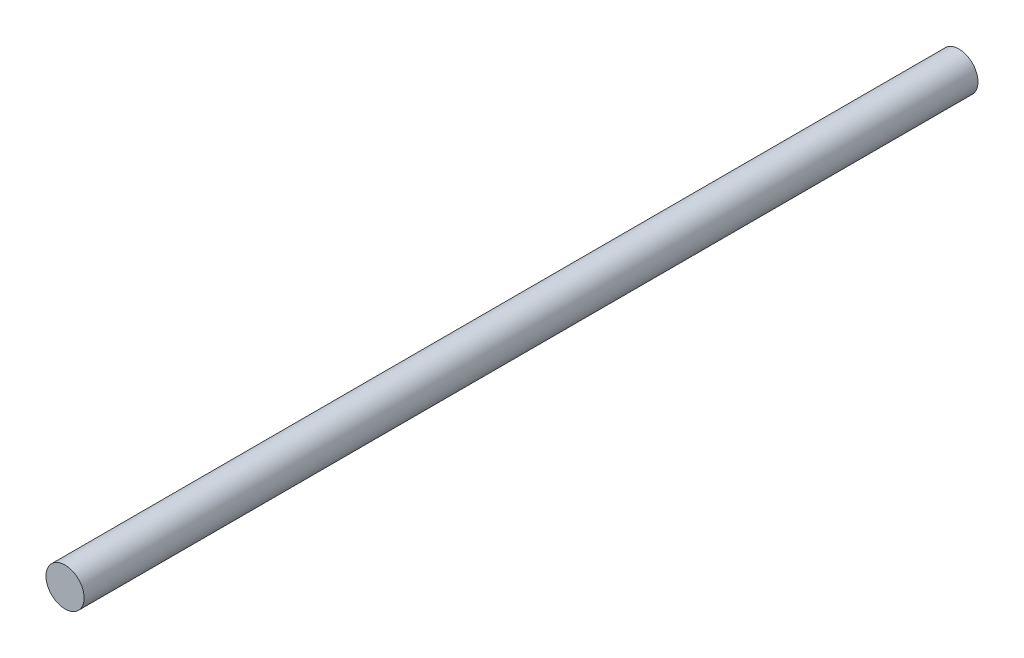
from build123d import *

# Parameters (mm, degrees)
SKETCH_1_R      = 1.6
EXTRUDE_1_DEPTH = 75


with BuildPart() as part:
    # Sketch 1 → Extrude 1 (new body)
    with BuildSketch(Plane.XY):
        Circle(SKETCH_1_R)
    extrude(amount=EXTRUDE_1_DEPTH)


solid = part.part
